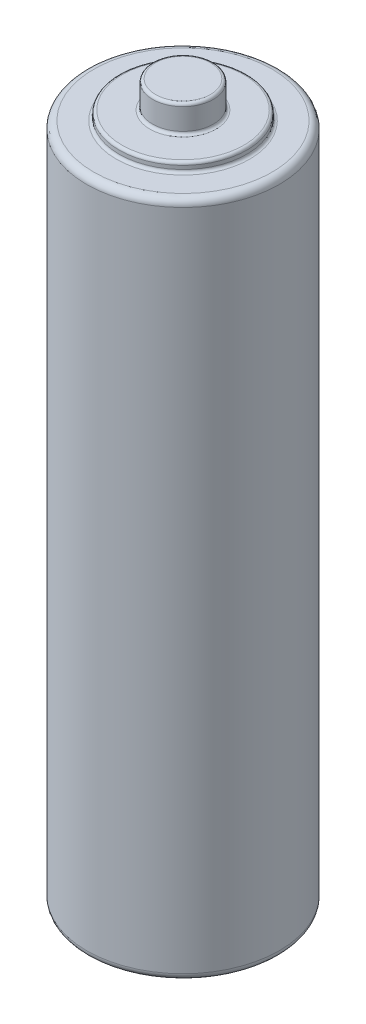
ISO-10303-21;
HEADER;
FILE_DESCRIPTION(('STEP AP214'),'2;1');
FILE_NAME('part.step','',(''),(''),'','','');
FILE_SCHEMA(('AUTOMOTIVE_DESIGN { 1 0 10303 214 1 1 1 1 }'));
ENDSEC;
DATA;
#1=APPLICATION_CONTEXT('core data for automotive mechanical design processes');
#2=APPLICATION_PROTOCOL_DEFINITION('international standard','automotive_design',2000,#1);
#3=PRODUCT_CONTEXT('',#1,'mechanical');
#4=PRODUCT('Part','Part','',(#3));
#5=PRODUCT_RELATED_PRODUCT_CATEGORY('part','',(#4));
#6=PRODUCT_DEFINITION_FORMATION('','',#4);
#7=PRODUCT_DEFINITION_CONTEXT('part definition',#1,'design');
#8=PRODUCT_DEFINITION('design','',#6,#7);
#9=PRODUCT_DEFINITION_SHAPE('','',#8);
#10=(LENGTH_UNIT() NAMED_UNIT(*) SI_UNIT(.MILLI.,.METRE.));
#11=(NAMED_UNIT(*) PLANE_ANGLE_UNIT() SI_UNIT($,.RADIAN.));
#12=(NAMED_UNIT(*) SI_UNIT($,.STERADIAN.) SOLID_ANGLE_UNIT());
#13=UNCERTAINTY_MEASURE_WITH_UNIT(LENGTH_MEASURE(1.E-05),#10,'distance_accuracy_value','');
#14=(GEOMETRIC_REPRESENTATION_CONTEXT(3) GLOBAL_UNCERTAINTY_ASSIGNED_CONTEXT((#13)) GLOBAL_UNIT_ASSIGNED_CONTEXT((#10,
#11,#12)) REPRESENTATION_CONTEXT('',''));
#15=CARTESIAN_POINT('',(0.,0.,0.));
#16=DIRECTION('',(0.,0.,1.));
#17=DIRECTION('',(1.,0.,0.));
#18=AXIS2_PLACEMENT_3D('',#15,#16,#17);
#19=CARTESIAN_POINT('',(0.,0.,0.));
#20=DIRECTION('',(0.,1.,0.));
#21=DIRECTION('',(0.,0.,1.));
#22=AXIS2_PLACEMENT_3D('',#19,#20,#21);
#23=PLANE('',#22);
#24=CARTESIAN_POINT('',(0.,0.,0.));
#25=DIRECTION('',(0.,1.,0.));
#26=DIRECTION('',(0.,0.,1.));
#27=AXIS2_PLACEMENT_3D('',#24,#25,#26);
#28=CIRCLE('',#27,6.25);
#29=CARTESIAN_POINT('',(0.,0.,6.25));
#30=VERTEX_POINT('',#29);
#31=EDGE_CURVE('E35',#30,#30,#28,.F.);
#32=ORIENTED_EDGE('',*,*,#31,.T.);
#33=EDGE_LOOP('',(#32));
#34=FACE_BOUND('',#33,.T.);
#35=CARTESIAN_POINT('',(0.,0.,0.));
#36=DIRECTION('',(0.,1.,0.));
#37=DIRECTION('',(0.,0.,1.));
#38=AXIS2_PLACEMENT_3D('',#35,#36,#37);
#39=CIRCLE('',#38,5.);
#40=CARTESIAN_POINT('',(0.,0.,5.));
#41=VERTEX_POINT('',#40);
#42=EDGE_CURVE('E60',#41,#41,#39,.F.);
#43=ORIENTED_EDGE('',*,*,#42,.F.);
#44=EDGE_LOOP('',(#43));
#45=FACE_BOUND('',#44,.T.);
#46=ADVANCED_FACE('F28',(#34,#45),#23,.F.);
#47=CARTESIAN_POINT('',(0.,48.15,0.));
#48=DIRECTION('',(0.,1.,0.));
#49=DIRECTION('',(0.,0.,1.));
#50=AXIS2_PLACEMENT_3D('',#47,#48,#49);
#51=PLANE('',#50);
#52=CARTESIAN_POINT('',(0.,48.15,0.));
#53=DIRECTION('',(0.,1.,0.));
#54=DIRECTION('',(0.,0.,1.));
#55=AXIS2_PLACEMENT_3D('',#52,#53,#54);
#56=CIRCLE('',#55,4.275);
#57=CARTESIAN_POINT('',(0.,48.15,4.275));
#58=VERTEX_POINT('',#57);
#59=EDGE_CURVE('E63',#58,#58,#56,.T.);
#60=ORIENTED_EDGE('',*,*,#59,.T.);
#61=EDGE_LOOP('',(#60));
#62=FACE_BOUND('',#61,.T.);
#63=CARTESIAN_POINT('',(0.,48.15,0.));
#64=DIRECTION('',(0.,1.,0.));
#65=DIRECTION('',(0.,0.,1.));
#66=AXIS2_PLACEMENT_3D('',#63,#64,#65);
#67=CIRCLE('',#66,2.325);
#68=CARTESIAN_POINT('',(0.,48.15,2.325));
#69=VERTEX_POINT('',#68);
#70=EDGE_CURVE('E75',#69,#69,#67,.F.);
#71=ORIENTED_EDGE('',*,*,#70,.T.);
#72=EDGE_LOOP('',(#71));
#73=FACE_BOUND('',#72,.T.);
#74=ADVANCED_FACE('F110',(#62,#73),#51,.T.);
#75=CARTESIAN_POINT('',(0.,47.5,0.));
#76=DIRECTION('',(0.,1.,0.));
#77=DIRECTION('',(0.,0.,1.));
#78=AXIS2_PLACEMENT_3D('',#75,#76,#77);
#79=PLANE('',#78);
#80=CARTESIAN_POINT('',(0.,47.5,0.));
#81=DIRECTION('',(0.,1.,0.));
#82=DIRECTION('',(0.,0.,1.));
#83=AXIS2_PLACEMENT_3D('',#80,#81,#82);
#84=CIRCLE('',#83,6.25);
#85=CARTESIAN_POINT('',(0.,47.5,6.25));
#86=VERTEX_POINT('',#85);
#87=EDGE_CURVE('E10',#86,#86,#84,.T.);
#88=ORIENTED_EDGE('',*,*,#87,.T.);
#89=EDGE_LOOP('',(#88));
#90=FACE_BOUND('',#89,.T.);
#91=CARTESIAN_POINT('',(0.,47.5,0.));
#92=DIRECTION('',(0.,1.,0.));
#93=DIRECTION('',(0.,0.,1.));
#94=AXIS2_PLACEMENT_3D('',#91,#92,#93);
#95=CIRCLE('',#94,4.675);
#96=CARTESIAN_POINT('',(0.,47.5,4.675));
#97=VERTEX_POINT('',#96);
#98=EDGE_CURVE('E66',#97,#97,#95,.F.);
#99=ORIENTED_EDGE('',*,*,#98,.T.);
#100=EDGE_LOOP('',(#99));
#101=FACE_BOUND('',#100,.T.);
#102=ADVANCED_FACE('F115',(#90,#101),#79,.T.);
#103=CARTESIAN_POINT('',(0.,47.5,0.));
#104=DIRECTION('',(0.,-1.,0.));
#105=DIRECTION('',(0.,0.,-1.));
#106=AXIS2_PLACEMENT_3D('',#103,#104,#105);
#107=CYLINDRICAL_SURFACE('',#106,6.75);
#108=CARTESIAN_POINT('',(0.,0.5,0.));
#109=DIRECTION('',(0.,1.,0.));
#110=DIRECTION('',(0.,0.,1.));
#111=AXIS2_PLACEMENT_3D('',#108,#109,#110);
#112=CIRCLE('',#111,6.75);
#113=CARTESIAN_POINT('',(0.,0.5,6.75));
#114=VERTEX_POINT('',#113);
#115=EDGE_CURVE('E39',#114,#114,#112,.T.);
#116=ORIENTED_EDGE('',*,*,#115,.T.);
#117=EDGE_LOOP('',(#116));
#118=FACE_BOUND('',#117,.T.);
#119=CARTESIAN_POINT('',(0.,47.,0.));
#120=DIRECTION('',(0.,1.,0.));
#121=DIRECTION('',(0.,0.,1.));
#122=AXIS2_PLACEMENT_3D('',#119,#120,#121);
#123=CIRCLE('',#122,6.75);
#124=CARTESIAN_POINT('',(0.,47.,6.75));
#125=VERTEX_POINT('',#124);
#126=EDGE_CURVE('E43',#125,#125,#123,.F.);
#127=ORIENTED_EDGE('',*,*,#126,.T.);
#128=EDGE_LOOP('',(#127));
#129=FACE_BOUND('',#128,.T.);
#130=ADVANCED_FACE('F30',(#118,#129),#107,.T.);
#131=CARTESIAN_POINT('',(0.,48.15,0.));
#132=DIRECTION('',(0.,-1.,0.));
#133=DIRECTION('',(0.,0.,-1.));
#134=AXIS2_PLACEMENT_3D('',#131,#132,#133);
#135=CYLINDRICAL_SURFACE('',#134,4.475);
#136=CARTESIAN_POINT('',(0.,47.7,0.));
#137=DIRECTION('',(0.,1.,0.));
#138=DIRECTION('',(0.,0.,1.));
#139=AXIS2_PLACEMENT_3D('',#136,#137,#138);
#140=CIRCLE('',#139,4.475);
#141=CARTESIAN_POINT('',(0.,47.7,4.475));
#142=VERTEX_POINT('',#141);
#143=EDGE_CURVE('E69',#142,#142,#140,.T.);
#144=ORIENTED_EDGE('',*,*,#143,.T.);
#145=EDGE_LOOP('',(#144));
#146=FACE_BOUND('',#145,.T.);
#147=CARTESIAN_POINT('',(0.,47.95,0.));
#148=DIRECTION('',(0.,1.,0.));
#149=DIRECTION('',(0.,0.,1.));
#150=AXIS2_PLACEMENT_3D('',#147,#148,#149);
#151=CIRCLE('',#150,4.475);
#152=CARTESIAN_POINT('',(0.,47.95,4.475));
#153=VERTEX_POINT('',#152);
#154=EDGE_CURVE('E72',#153,#153,#151,.F.);
#155=ORIENTED_EDGE('',*,*,#154,.T.);
#156=EDGE_LOOP('',(#155));
#157=FACE_BOUND('',#156,.T.);
#158=ADVANCED_FACE('F120',(#146,#157),#135,.T.);
#159=CARTESIAN_POINT('',(0.,50.05,0.));
#160=DIRECTION('',(0.,-1.,0.));
#161=DIRECTION('',(0.,0.,-1.));
#162=AXIS2_PLACEMENT_3D('',#159,#160,#161);
#163=CYLINDRICAL_SURFACE('',#162,2.125);
#164=CARTESIAN_POINT('',(0.,48.35,0.));
#165=DIRECTION('',(0.,1.,0.));
#166=DIRECTION('',(0.,0.,1.));
#167=AXIS2_PLACEMENT_3D('',#164,#165,#166);
#168=CIRCLE('',#167,2.125);
#169=CARTESIAN_POINT('',(0.,48.35,-2.125));
#170=VERTEX_POINT('',#169);
#171=EDGE_CURVE('E78',#170,#170,#168,.T.);
#172=CARTESIAN_POINT('',(0.,49.85,0.));
#173=DIRECTION('',(0.,1.,0.));
#174=DIRECTION('',(0.,0.,1.));
#175=AXIS2_PLACEMENT_3D('',#172,#173,#174);
#176=CIRCLE('',#175,2.125);
#177=CARTESIAN_POINT('',(0.,49.85,-2.125));
#178=VERTEX_POINT('',#177);
#179=EDGE_CURVE('E81',#178,#178,#176,.F.);
#180=CARTESIAN_POINT('',(0.,48.35,-2.125));
#181=CARTESIAN_POINT('',(0.,48.365625,-2.125));
#182=CARTESIAN_POINT('',(0.,48.38125,-2.125));
#183=CARTESIAN_POINT('',(0.,48.4125,-2.125));
#184=CARTESIAN_POINT('',(0.,48.428125,-2.125));
#185=CARTESIAN_POINT('',(0.,48.459375,-2.125));
#186=CARTESIAN_POINT('',(0.,48.475,-2.125));
#187=CARTESIAN_POINT('',(0.,48.50625,-2.125));
#188=CARTESIAN_POINT('',(0.,48.521875,-2.125));
#189=CARTESIAN_POINT('',(0.,48.553125,-2.125));
#190=CARTESIAN_POINT('',(0.,48.56875,-2.125));
#191=CARTESIAN_POINT('',(0.,48.6,-2.125));
#192=CARTESIAN_POINT('',(0.,48.615625,-2.125));
#193=CARTESIAN_POINT('',(0.,48.646875,-2.125));
#194=CARTESIAN_POINT('',(0.,48.6625,-2.125));
#195=CARTESIAN_POINT('',(0.,48.69375,-2.125));
#196=CARTESIAN_POINT('',(0.,48.709375,-2.125));
#197=CARTESIAN_POINT('',(0.,48.740625,-2.125));
#198=CARTESIAN_POINT('',(0.,48.75625,-2.125));
#199=CARTESIAN_POINT('',(0.,48.7875,-2.125));
#200=CARTESIAN_POINT('',(0.,48.803125,-2.125));
#201=CARTESIAN_POINT('',(0.,48.834375,-2.125));
#202=CARTESIAN_POINT('',(0.,48.85,-2.125));
#203=CARTESIAN_POINT('',(0.,48.88125,-2.125));
#204=CARTESIAN_POINT('',(0.,48.896875,-2.125));
#205=CARTESIAN_POINT('',(0.,48.928125,-2.125));
#206=CARTESIAN_POINT('',(0.,48.94375,-2.125));
#207=CARTESIAN_POINT('',(0.,48.975,-2.125));
#208=CARTESIAN_POINT('',(0.,48.990625,-2.125));
#209=CARTESIAN_POINT('',(0.,49.021875,-2.125));
#210=CARTESIAN_POINT('',(0.,49.0375,-2.125));
#211=CARTESIAN_POINT('',(0.,49.06875,-2.125));
#212=CARTESIAN_POINT('',(0.,49.084375,-2.125));
#213=CARTESIAN_POINT('',(0.,49.115625,-2.125));
#214=CARTESIAN_POINT('',(0.,49.13125,-2.125));
#215=CARTESIAN_POINT('',(0.,49.1625,-2.125));
#216=CARTESIAN_POINT('',(0.,49.178125,-2.125));
#217=CARTESIAN_POINT('',(0.,49.209375,-2.125));
#218=CARTESIAN_POINT('',(0.,49.225,-2.125));
#219=CARTESIAN_POINT('',(0.,49.25625,-2.125));
#220=CARTESIAN_POINT('',(0.,49.271875,-2.125));
#221=CARTESIAN_POINT('',(0.,49.303125,-2.125));
#222=CARTESIAN_POINT('',(0.,49.31875,-2.125));
#223=CARTESIAN_POINT('',(0.,49.35,-2.125));
#224=CARTESIAN_POINT('',(0.,49.365625,-2.125));
#225=CARTESIAN_POINT('',(0.,49.396875,-2.125));
#226=CARTESIAN_POINT('',(0.,49.4125,-2.125));
#227=CARTESIAN_POINT('',(0.,49.44375,-2.125));
#228=CARTESIAN_POINT('',(0.,49.459375,-2.125));
#229=CARTESIAN_POINT('',(0.,49.490625,-2.125));
#230=CARTESIAN_POINT('',(0.,49.50625,-2.125));
#231=CARTESIAN_POINT('',(0.,49.5375,-2.125));
#232=CARTESIAN_POINT('',(0.,49.553125,-2.125));
#233=CARTESIAN_POINT('',(0.,49.584375,-2.125));
#234=CARTESIAN_POINT('',(0.,49.6,-2.125));
#235=CARTESIAN_POINT('',(0.,49.63125,-2.125));
#236=CARTESIAN_POINT('',(0.,49.646875,-2.125));
#237=CARTESIAN_POINT('',(0.,49.678125,-2.125));
#238=CARTESIAN_POINT('',(0.,49.69375,-2.125));
#239=CARTESIAN_POINT('',(0.,49.725,-2.125));
#240=CARTESIAN_POINT('',(0.,49.740625,-2.125));
#241=CARTESIAN_POINT('',(0.,49.771875,-2.125));
#242=CARTESIAN_POINT('',(0.,49.7875,-2.125));
#243=CARTESIAN_POINT('',(0.,49.81875,-2.125));
#244=CARTESIAN_POINT('',(0.,49.834375,-2.125));
#245=CARTESIAN_POINT('',(0.,49.85,-2.125));
#246=B_SPLINE_CURVE_WITH_KNOTS('',3,(#180,#181,#182,#183,#184,#185,#186,#187,#188,#189,#190,
#191,#192,#193,#194,#195,#196,#197,#198,#199,#200,#201,#202,#203,#204,#205,#206,#207,#208,#209,
#210,#211,#212,#213,#214,#215,#216,#217,#218,#219,#220,#221,#222,#223,#224,#225,#226,#227,#228,
#229,#230,#231,#232,#233,#234,#235,#236,#237,#238,#239,#240,#241,#242,#243,#244,#245),
.UNSPECIFIED.,.F.,.F.,(4,2,2,2,2,2,2,2,2,2,2,2,2,2,2,2,2,2,2,2,2,2,2,2,2,2,2,2,2,2,2,2,4),(0.,
0.0468749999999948,0.0937499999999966,0.140624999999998,0.1875,0.234374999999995,
0.281249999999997,0.328124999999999,0.375,0.421874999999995,0.468749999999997,0.515624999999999,
0.5625,0.609374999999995,0.656249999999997,0.703124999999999,0.750000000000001,
0.796874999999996,0.843749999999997,0.890624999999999,0.937500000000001,0.984374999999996,
1.03125,1.078125,1.125,1.171875,1.21875,1.265625,1.3125,1.359375,1.40625,1.453125,1.5),.UNSPECIFIED.);
#247=EDGE_CURVE('BSEAM139',#170,#178,#246,.T.);
#248=ORIENTED_EDGE('',*,*,#171,.T.);
#249=ORIENTED_EDGE('',*,*,#179,.T.);
#250=ORIENTED_EDGE('',*,*,#247,.T.);
#251=ORIENTED_EDGE('',*,*,#247,.F.);
#252=EDGE_LOOP('',(#248,#250,#249,#251));
#253=FACE_BOUND('',#252,.T.);
#254=ADVANCED_FACE('F139',(#253),#163,.T.);
#255=CARTESIAN_POINT('',(0.,50.05,0.));
#256=DIRECTION('',(0.,1.,0.));
#257=DIRECTION('',(0.,0.,1.));
#258=AXIS2_PLACEMENT_3D('',#255,#256,#257);
#259=PLANE('',#258);
#260=CARTESIAN_POINT('',(0.,50.05,0.));
#261=DIRECTION('',(0.,1.,0.));
#262=DIRECTION('',(0.,0.,1.));
#263=AXIS2_PLACEMENT_3D('',#260,#261,#262);
#264=CIRCLE('',#263,1.925);
#265=CARTESIAN_POINT('',(0.,50.05,1.925));
#266=VERTEX_POINT('',#265);
#267=EDGE_CURVE('E84',#266,#266,#264,.T.);
#268=ORIENTED_EDGE('',*,*,#267,.T.);
#269=EDGE_LOOP('',(#268));
#270=FACE_BOUND('',#269,.T.);
#271=ADVANCED_FACE('F158',(#270),#259,.T.);
#272=CARTESIAN_POINT('',(0.,49.85,0.));
#273=DIRECTION('',(0.,1.,0.));
#274=DIRECTION('',(0.,0.,1.));
#275=AXIS2_PLACEMENT_3D('',#272,#273,#274);
#276=TOROIDAL_SURFACE('',#275,1.925,0.2);
#277=ORIENTED_EDGE('',*,*,#179,.F.);
#278=EDGE_LOOP('',(#277));
#279=FACE_BOUND('',#278,.T.);
#280=ORIENTED_EDGE('',*,*,#267,.F.);
#281=EDGE_LOOP('',(#280));
#282=FACE_BOUND('',#281,.T.);
#283=ADVANCED_FACE('F152',(#279,#282),#276,.T.);
#284=CARTESIAN_POINT('',(0.,48.35,0.));
#285=DIRECTION('',(0.,1.,0.));
#286=DIRECTION('',(0.,0.,1.));
#287=AXIS2_PLACEMENT_3D('',#284,#285,#286);
#288=TOROIDAL_SURFACE('',#287,2.325,0.2);
#289=ORIENTED_EDGE('',*,*,#70,.F.);
#290=EDGE_LOOP('',(#289));
#291=FACE_BOUND('',#290,.T.);
#292=ORIENTED_EDGE('',*,*,#171,.F.);
#293=EDGE_LOOP('',(#292));
#294=FACE_BOUND('',#293,.T.);
#295=ADVANCED_FACE('F133',(#291,#294),#288,.F.);
#296=CARTESIAN_POINT('',(0.,47.7,0.));
#297=DIRECTION('',(0.,1.,0.));
#298=DIRECTION('',(0.,0.,1.));
#299=AXIS2_PLACEMENT_3D('',#296,#297,#298);
#300=TOROIDAL_SURFACE('',#299,4.675,0.2);
#301=ORIENTED_EDGE('',*,*,#98,.F.);
#302=EDGE_LOOP('',(#301));
#303=FACE_BOUND('',#302,.T.);
#304=ORIENTED_EDGE('',*,*,#143,.F.);
#305=EDGE_LOOP('',(#304));
#306=FACE_BOUND('',#305,.T.);
#307=ADVANCED_FACE('F129',(#303,#306),#300,.F.);
#308=CARTESIAN_POINT('',(0.,47.95,0.));
#309=DIRECTION('',(0.,1.,0.));
#310=DIRECTION('',(0.,0.,1.));
#311=AXIS2_PLACEMENT_3D('',#308,#309,#310);
#312=TOROIDAL_SURFACE('',#311,4.275,0.2);
#313=ORIENTED_EDGE('',*,*,#154,.F.);
#314=EDGE_LOOP('',(#313));
#315=FACE_BOUND('',#314,.T.);
#316=ORIENTED_EDGE('',*,*,#59,.F.);
#317=EDGE_LOOP('',(#316));
#318=FACE_BOUND('',#317,.T.);
#319=ADVANCED_FACE('F132',(#315,#318),#312,.T.);
#320=CARTESIAN_POINT('',(0.,-0.1,0.));
#321=DIRECTION('',(0.,1.,0.));
#322=DIRECTION('',(0.,0.,1.));
#323=AXIS2_PLACEMENT_3D('',#320,#321,#322);
#324=CYLINDRICAL_SURFACE('',#323,5.);
#325=CARTESIAN_POINT('',(0.,-0.05,0.));
#326=DIRECTION('',(0.,-1.,0.));
#327=DIRECTION('',(0.,0.,-1.));
#328=AXIS2_PLACEMENT_3D('',#325,#326,#327);
#329=CIRCLE('',#328,5.);
#330=CARTESIAN_POINT('',(0.,-0.05,-5.));
#331=VERTEX_POINT('',#330);
#332=EDGE_CURVE('E48',#331,#331,#329,.F.);
#333=ORIENTED_EDGE('',*,*,#332,.T.);
#334=EDGE_LOOP('',(#333));
#335=FACE_BOUND('',#334,.T.);
#336=ORIENTED_EDGE('',*,*,#42,.T.);
#337=EDGE_LOOP('',(#336));
#338=FACE_BOUND('',#337,.T.);
#339=ADVANCED_FACE('F144',(#335,#338),#324,.T.);
#340=CARTESIAN_POINT('',(0.,-0.1,0.));
#341=DIRECTION('',(0.,-1.,0.));
#342=DIRECTION('',(0.,0.,-1.));
#343=AXIS2_PLACEMENT_3D('',#340,#341,#342);
#344=PLANE('',#343);
#345=CARTESIAN_POINT('',(0.,-0.1,0.));
#346=DIRECTION('',(0.,-1.,0.));
#347=DIRECTION('',(0.,0.,-1.));
#348=AXIS2_PLACEMENT_3D('',#345,#346,#347);
#349=CIRCLE('',#348,2.05);
#350=CARTESIAN_POINT('',(0.,-0.1,-2.05));
#351=VERTEX_POINT('',#350);
#352=EDGE_CURVE('E54',#351,#351,#349,.F.);
#353=ORIENTED_EDGE('',*,*,#352,.T.);
#354=EDGE_LOOP('',(#353));
#355=FACE_BOUND('',#354,.T.);
#356=CARTESIAN_POINT('',(0.,-0.1,0.));
#357=DIRECTION('',(0.,-1.,0.));
#358=DIRECTION('',(0.,0.,-1.));
#359=AXIS2_PLACEMENT_3D('',#356,#357,#358);
#360=CIRCLE('',#359,4.95);
#361=CARTESIAN_POINT('',(0.,-0.1,-4.95));
#362=VERTEX_POINT('',#361);
#363=EDGE_CURVE('E57',#362,#362,#360,.T.);
#364=ORIENTED_EDGE('',*,*,#363,.T.);
#365=EDGE_LOOP('',(#364));
#366=FACE_BOUND('',#365,.T.);
#367=ADVANCED_FACE('F105',(#355,#366),#344,.T.);
#368=CARTESIAN_POINT('',(0.,0.,0.));
#369=DIRECTION('',(0.,-1.,0.));
#370=DIRECTION('',(0.,0.,-1.));
#371=AXIS2_PLACEMENT_3D('',#368,#369,#370);
#372=PLANE('',#371);
#373=CARTESIAN_POINT('',(0.,0.,0.));
#374=DIRECTION('',(0.,-1.,0.));
#375=DIRECTION('',(0.,0.,-1.));
#376=AXIS2_PLACEMENT_3D('',#373,#374,#375);
#377=CIRCLE('',#376,1.95);
#378=CARTESIAN_POINT('',(0.,0.,-1.95));
#379=VERTEX_POINT('',#378);
#380=EDGE_CURVE('E51',#379,#379,#377,.T.);
#381=ORIENTED_EDGE('',*,*,#380,.T.);
#382=EDGE_LOOP('',(#381));
#383=FACE_BOUND('',#382,.T.);
#384=ADVANCED_FACE('F95',(#383),#372,.T.);
#385=CARTESIAN_POINT('',(0.,-0.05,0.));
#386=DIRECTION('',(0.,-1.,0.));
#387=DIRECTION('',(0.,0.,-1.));
#388=AXIS2_PLACEMENT_3D('',#385,#386,#387);
#389=TOROIDAL_SURFACE('',#388,1.95,0.05);
#390=ORIENTED_EDGE('',*,*,#380,.F.);
#391=EDGE_LOOP('',(#390));
#392=FACE_BOUND('',#391,.T.);
#393=CARTESIAN_POINT('',(0.,-0.05,0.));
#394=DIRECTION('',(0.,-1.,0.));
#395=DIRECTION('',(0.,0.,-1.));
#396=AXIS2_PLACEMENT_3D('',#393,#394,#395);
#397=CIRCLE('',#396,2.);
#398=CARTESIAN_POINT('',(0.,-0.05,-2.));
#399=VERTEX_POINT('',#398);
#400=EDGE_CURVE('E87',#399,#399,#397,.F.);
#401=ORIENTED_EDGE('',*,*,#400,.F.);
#402=EDGE_LOOP('',(#401));
#403=FACE_BOUND('',#402,.T.);
#404=ADVANCED_FACE('F93',(#392,#403),#389,.F.);
#405=CARTESIAN_POINT('',(0.,-0.05,0.));
#406=DIRECTION('',(0.,-1.,0.));
#407=DIRECTION('',(0.,0.,-1.));
#408=AXIS2_PLACEMENT_3D('',#405,#406,#407);
#409=TOROIDAL_SURFACE('',#408,2.05,0.05);
#410=ORIENTED_EDGE('',*,*,#352,.F.);
#411=EDGE_LOOP('',(#410));
#412=FACE_BOUND('',#411,.T.);
#413=ORIENTED_EDGE('',*,*,#400,.T.);
#414=EDGE_LOOP('',(#413));
#415=FACE_BOUND('',#414,.T.);
#416=ADVANCED_FACE('F91',(#412,#415),#409,.T.);
#417=CARTESIAN_POINT('',(0.,-0.05,0.));
#418=DIRECTION('',(0.,-1.,0.));
#419=DIRECTION('',(0.,0.,-1.));
#420=AXIS2_PLACEMENT_3D('',#417,#418,#419);
#421=TOROIDAL_SURFACE('',#420,4.95,0.05);
#422=ORIENTED_EDGE('',*,*,#332,.F.);
#423=EDGE_LOOP('',(#422));
#424=FACE_BOUND('',#423,.T.);
#425=ORIENTED_EDGE('',*,*,#363,.F.);
#426=EDGE_LOOP('',(#425));
#427=FACE_BOUND('',#426,.T.);
#428=ADVANCED_FACE('F102',(#424,#427),#421,.T.);
#429=CARTESIAN_POINT('',(0.,0.5,0.));
#430=DIRECTION('',(0.,1.,0.));
#431=DIRECTION('',(0.,0.,1.));
#432=AXIS2_PLACEMENT_3D('',#429,#430,#431);
#433=TOROIDAL_SURFACE('',#432,6.25,0.5);
#434=ORIENTED_EDGE('',*,*,#31,.F.);
#435=EDGE_LOOP('',(#434));
#436=FACE_BOUND('',#435,.T.);
#437=ORIENTED_EDGE('',*,*,#115,.F.);
#438=EDGE_LOOP('',(#437));
#439=FACE_BOUND('',#438,.T.);
#440=ADVANCED_FACE('F184',(#436,#439),#433,.T.);
#441=CARTESIAN_POINT('',(0.,47.,0.));
#442=DIRECTION('',(0.,1.,0.));
#443=DIRECTION('',(0.,0.,1.));
#444=AXIS2_PLACEMENT_3D('',#441,#442,#443);
#445=TOROIDAL_SURFACE('',#444,6.25,0.5);
#446=ORIENTED_EDGE('',*,*,#126,.F.);
#447=EDGE_LOOP('',(#446));
#448=FACE_BOUND('',#447,.T.);
#449=ORIENTED_EDGE('',*,*,#87,.F.);
#450=EDGE_LOOP('',(#449));
#451=FACE_BOUND('',#450,.T.);
#452=ADVANCED_FACE('F190',(#448,#451),#445,.T.);
#453=CLOSED_SHELL('',(#46,#74,#102,#130,#158,#254,#271,#283,#295,#307,#319,#339,#367,#384,#404,
#416,#428,#440,#452));
#454=MANIFOLD_SOLID_BREP('B2',#453);
#455=ADVANCED_BREP_SHAPE_REPRESENTATION('',(#18,#454),#14);
#456=SHAPE_DEFINITION_REPRESENTATION(#9,#455);
ENDSEC;
END-ISO-10303-21;
